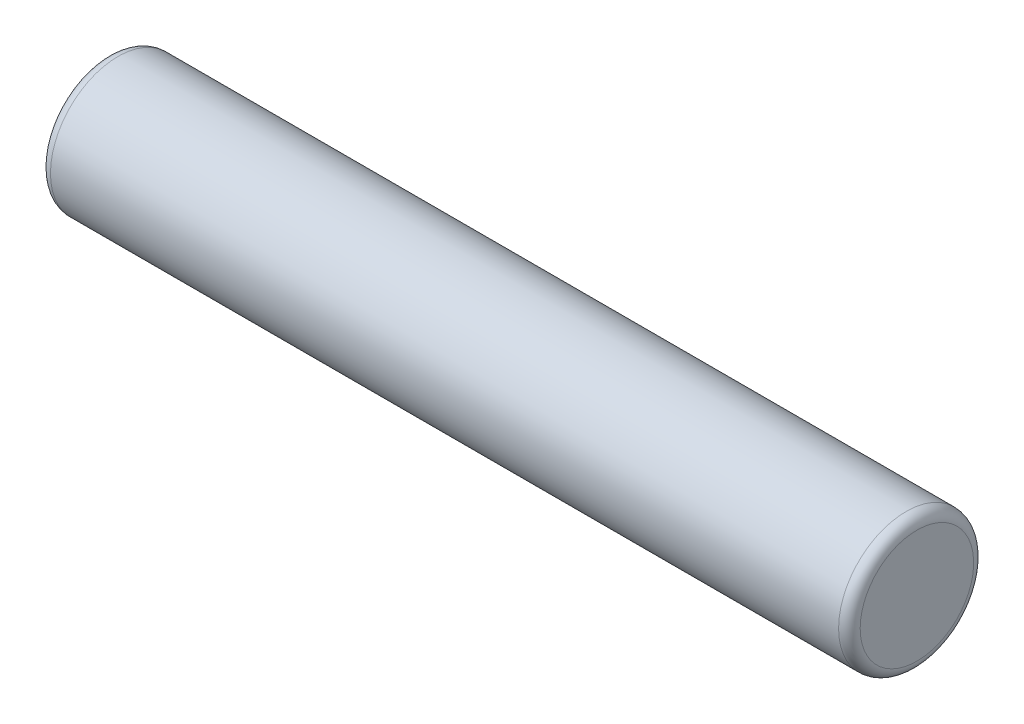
from build123d import *


with BuildPart() as part:
    # Sketch1 → Base-Revolve (revolve)
    with BuildSketch(Plane.XY, mode=Mode.PRIVATE) as base_revolve_sk:
        with BuildLine():
            Line((0, 0), (38.1, 0))
            Line((38.1, 0), (38.1, 2.66954))
            ThreePointArc((38.1, 2.66954), (37.951210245, 3.028750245), (37.592, 3.17754))
            Line((37.592, 3.17754), (0.508, 3.17754))
            ThreePointArc((0.508, 3.17754), (0.148789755, 3.028750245), (0, 2.66954))
            Line((0, 2.66954), (0, 0))
        make_face()
    revolve(base_revolve_sk.sketch.rotate(Axis((-6.35, 0, 0), (1, 0, 0)), 90), axis=Axis((-6.35, 0, 0), (1, 0, 0)))


solid = part.part
